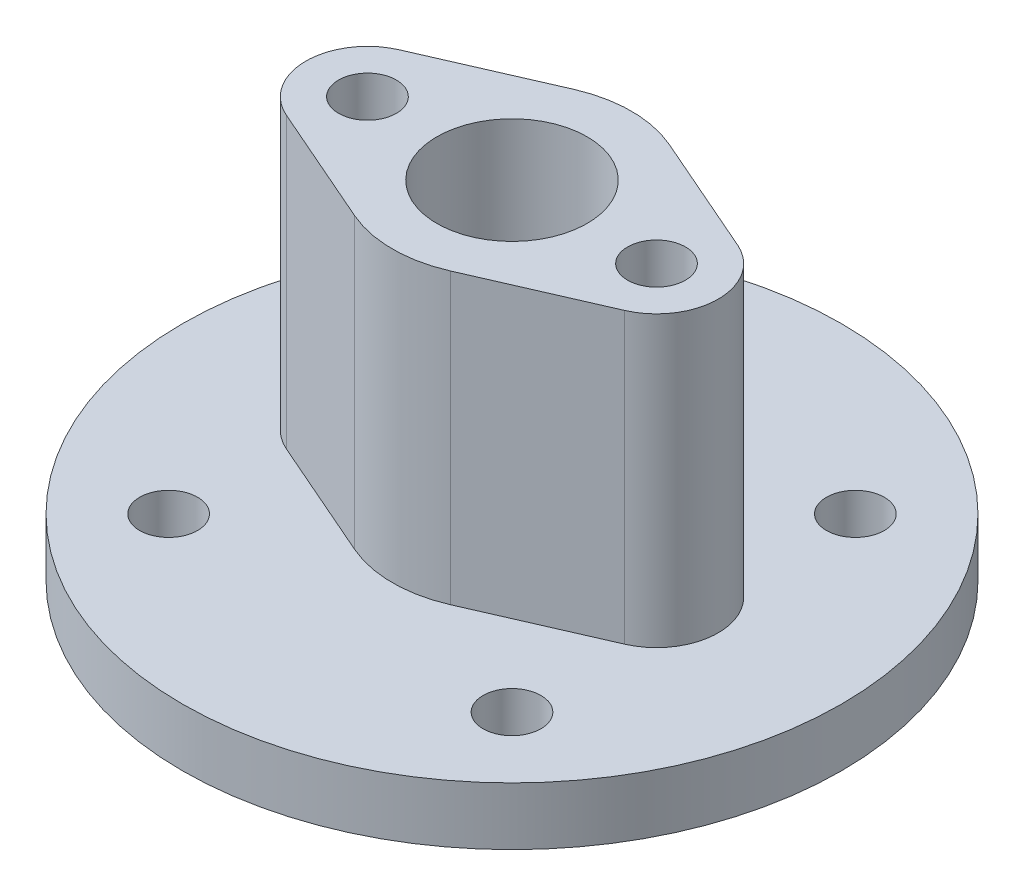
ISO-10303-21;
HEADER;
FILE_DESCRIPTION(('STEP AP214'),'2;1');
FILE_NAME('part.step','',(''),(''),'','','');
FILE_SCHEMA(('AUTOMOTIVE_DESIGN { 1 0 10303 214 1 1 1 1 }'));
ENDSEC;
DATA;
#1=APPLICATION_CONTEXT('core data for automotive mechanical design processes');
#2=APPLICATION_PROTOCOL_DEFINITION('international standard','automotive_design',2000,#1);
#3=PRODUCT_CONTEXT('',#1,'mechanical');
#4=PRODUCT('Part','Part','',(#3));
#5=PRODUCT_RELATED_PRODUCT_CATEGORY('part','',(#4));
#6=PRODUCT_DEFINITION_FORMATION('','',#4);
#7=PRODUCT_DEFINITION_CONTEXT('part definition',#1,'design');
#8=PRODUCT_DEFINITION('design','',#6,#7);
#9=PRODUCT_DEFINITION_SHAPE('','',#8);
#10=(LENGTH_UNIT() NAMED_UNIT(*) SI_UNIT(.MILLI.,.METRE.));
#11=(NAMED_UNIT(*) PLANE_ANGLE_UNIT() SI_UNIT($,.RADIAN.));
#12=(NAMED_UNIT(*) SI_UNIT($,.STERADIAN.) SOLID_ANGLE_UNIT());
#13=UNCERTAINTY_MEASURE_WITH_UNIT(LENGTH_MEASURE(1.E-05),#10,'distance_accuracy_value','');
#14=(GEOMETRIC_REPRESENTATION_CONTEXT(3) GLOBAL_UNCERTAINTY_ASSIGNED_CONTEXT((#13)) GLOBAL_UNIT_ASSIGNED_CONTEXT((#10,
#11,#12)) REPRESENTATION_CONTEXT('',''));
#15=CARTESIAN_POINT('',(0.,0.,0.));
#16=DIRECTION('',(0.,0.,1.));
#17=DIRECTION('',(1.,0.,0.));
#18=AXIS2_PLACEMENT_3D('',#15,#16,#17);
#19=CARTESIAN_POINT('',(0.,57.,0.));
#20=DIRECTION('',(0.,-1.,0.));
#21=DIRECTION('',(0.,0.,-1.));
#22=AXIS2_PLACEMENT_3D('',#19,#20,#21);
#23=PLANE('',#22);
#24=CARTESIAN_POINT('',(44.5477272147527,57.,-44.5477272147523));
#25=DIRECTION('',(0.,1.,0.));
#26=DIRECTION('',(0.,0.,1.));
#27=AXIS2_PLACEMENT_3D('',#24,#25,#26);
#28=CIRCLE('',#27,7.49999999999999);
#29=CARTESIAN_POINT('',(44.5477272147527,57.,-37.0477272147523));
#30=VERTEX_POINT('',#29);
#31=EDGE_CURVE('E126',#30,#30,#28,.T.);
#32=ORIENTED_EDGE('',*,*,#31,.F.);
#33=EDGE_LOOP('',(#32));
#34=FACE_BOUND('',#33,.T.);
#35=CARTESIAN_POINT('',(44.5477272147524,57.,44.5477272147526));
#36=DIRECTION('',(0.,1.,0.));
#37=DIRECTION('',(0.,0.,1.));
#38=AXIS2_PLACEMENT_3D('',#35,#36,#37);
#39=CIRCLE('',#38,7.49999999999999);
#40=CARTESIAN_POINT('',(44.5477272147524,57.,52.0477272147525));
#41=VERTEX_POINT('',#40);
#42=EDGE_CURVE('E132',#41,#41,#39,.T.);
#43=ORIENTED_EDGE('',*,*,#42,.F.);
#44=EDGE_LOOP('',(#43));
#45=FACE_BOUND('',#44,.T.);
#46=CARTESIAN_POINT('',(-44.5477272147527,57.,44.5477272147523));
#47=DIRECTION('',(0.,1.,0.));
#48=DIRECTION('',(0.,0.,1.));
#49=AXIS2_PLACEMENT_3D('',#46,#47,#48);
#50=CIRCLE('',#49,7.49999999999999);
#51=CARTESIAN_POINT('',(-44.5477272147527,57.,52.0477272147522));
#52=VERTEX_POINT('',#51);
#53=EDGE_CURVE('E138',#52,#52,#50,.T.);
#54=ORIENTED_EDGE('',*,*,#53,.F.);
#55=EDGE_LOOP('',(#54));
#56=FACE_BOUND('',#55,.T.);
#57=CARTESIAN_POINT('',(0.,57.,0.));
#58=DIRECTION('',(0.,1.,0.));
#59=DIRECTION('',(0.,0.,1.));
#60=AXIS2_PLACEMENT_3D('',#57,#58,#59);
#61=CIRCLE('',#60,85.5);
#62=CARTESIAN_POINT('',(0.,57.,85.5));
#63=VERTEX_POINT('',#62);
#64=EDGE_CURVE('E11',#63,#63,#61,.T.);
#65=ORIENTED_EDGE('',*,*,#64,.T.);
#66=EDGE_LOOP('',(#65));
#67=FACE_BOUND('',#66,.T.);
#68=CARTESIAN_POINT('',(0.,57.,0.));
#69=DIRECTION('',(0.,1.,0.));
#70=DIRECTION('',(0.,0.,1.));
#71=AXIS2_PLACEMENT_3D('',#68,#69,#70);
#72=CIRCLE('',#71,31.);
#73=CARTESIAN_POINT('',(12.4,57.,-28.4119693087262));
#74=VERTEX_POINT('',#73);
#75=CARTESIAN_POINT('',(-12.4,57.,-28.4119693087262));
#76=VERTEX_POINT('',#75);
#77=EDGE_CURVE('E168',#74,#76,#72,.T.);
#78=ORIENTED_EDGE('',*,*,#77,.F.);
#79=DIRECTION('',(-0.916515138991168,0.,-0.399999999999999));
#80=VECTOR('',#79,1.);
#81=CARTESIAN_POINT('',(12.4,57.,-28.4119693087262));
#82=LINE('',#81,#80);
#83=CARTESIAN_POINT('',(43.9,57.,-14.6642422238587));
#84=VERTEX_POINT('',#83);
#85=EDGE_CURVE('E173',#84,#74,#82,.T.);
#86=ORIENTED_EDGE('',*,*,#85,.F.);
#87=CARTESIAN_POINT('',(37.5,57.,0.));
#88=DIRECTION('',(0.,1.,0.));
#89=DIRECTION('',(0.,0.,1.));
#90=AXIS2_PLACEMENT_3D('',#87,#88,#89);
#91=CIRCLE('',#90,16.);
#92=CARTESIAN_POINT('',(43.9,57.,14.6642422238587));
#93=VERTEX_POINT('',#92);
#94=EDGE_CURVE('E201',#93,#84,#91,.T.);
#95=ORIENTED_EDGE('',*,*,#94,.F.);
#96=DIRECTION('',(0.916515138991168,0.,-0.4));
#97=VECTOR('',#96,1.);
#98=CARTESIAN_POINT('',(12.4,57.,28.4119693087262));
#99=LINE('',#98,#97);
#100=CARTESIAN_POINT('',(12.4,57.,28.4119693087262));
#101=VERTEX_POINT('',#100);
#102=EDGE_CURVE('E198',#101,#93,#99,.T.);
#103=ORIENTED_EDGE('',*,*,#102,.F.);
#104=CARTESIAN_POINT('',(0.,57.,0.));
#105=DIRECTION('',(0.,1.,0.));
#106=DIRECTION('',(0.,0.,1.));
#107=AXIS2_PLACEMENT_3D('',#104,#105,#106);
#108=CIRCLE('',#107,31.);
#109=CARTESIAN_POINT('',(-12.4,57.,28.4119693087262));
#110=VERTEX_POINT('',#109);
#111=EDGE_CURVE('E195',#110,#101,#108,.T.);
#112=ORIENTED_EDGE('',*,*,#111,.F.);
#113=DIRECTION('',(0.916515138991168,0.,0.4));
#114=VECTOR('',#113,1.);
#115=CARTESIAN_POINT('',(-43.9,57.,14.6642422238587));
#116=LINE('',#115,#114);
#117=CARTESIAN_POINT('',(-43.9,57.,14.6642422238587));
#118=VERTEX_POINT('',#117);
#119=EDGE_CURVE('E192',#118,#110,#116,.T.);
#120=ORIENTED_EDGE('',*,*,#119,.F.);
#121=CARTESIAN_POINT('',(-37.5,57.,0.));
#122=DIRECTION('',(0.,1.,0.));
#123=DIRECTION('',(0.,0.,1.));
#124=AXIS2_PLACEMENT_3D('',#121,#122,#123);
#125=CIRCLE('',#124,16.);
#126=CARTESIAN_POINT('',(-43.9,57.,-14.6642422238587));
#127=VERTEX_POINT('',#126);
#128=EDGE_CURVE('E52',#127,#118,#125,.T.);
#129=ORIENTED_EDGE('',*,*,#128,.F.);
#130=DIRECTION('',(-0.916515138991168,0.,0.399999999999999));
#131=VECTOR('',#130,1.);
#132=CARTESIAN_POINT('',(-43.9,57.,-14.6642422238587));
#133=LINE('',#132,#131);
#134=EDGE_CURVE('E47',#76,#127,#133,.T.);
#135=ORIENTED_EDGE('',*,*,#134,.F.);
#136=EDGE_LOOP('',(#78,#86,#95,#103,#112,#120,#129,#135));
#137=FACE_BOUND('',#136,.T.);
#138=CARTESIAN_POINT('',(-44.5477272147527,57.,-44.5477272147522));
#139=DIRECTION('',(0.,1.,0.));
#140=DIRECTION('',(0.,0.,1.));
#141=AXIS2_PLACEMENT_3D('',#138,#139,#140);
#142=CIRCLE('',#141,7.49999999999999);
#143=CARTESIAN_POINT('',(-44.5477272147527,57.,-37.0477272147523));
#144=VERTEX_POINT('',#143);
#145=EDGE_CURVE('E120',#144,#144,#142,.T.);
#146=ORIENTED_EDGE('',*,*,#145,.F.);
#147=EDGE_LOOP('',(#146));
#148=FACE_BOUND('',#147,.T.);
#149=ADVANCED_FACE('F32',(#34,#45,#56,#67,#137,#148),#23,.F.);
#150=CARTESIAN_POINT('',(24.,0.,0.));
#151=DIRECTION('',(0.,1.,0.));
#152=DIRECTION('',(0.,0.,1.));
#153=AXIS2_PLACEMENT_3D('',#150,#151,#152);
#154=PLANE('',#153);
#155=CARTESIAN_POINT('',(0.,0.,0.));
#156=DIRECTION('',(0.,-1.,0.));
#157=DIRECTION('',(0.,0.,-1.));
#158=AXIS2_PLACEMENT_3D('',#155,#156,#157);
#159=CIRCLE('',#158,13.5);
#160=CARTESIAN_POINT('',(0.,0.,-13.5));
#161=VERTEX_POINT('',#160);
#162=EDGE_CURVE('E144',#161,#161,#159,.T.);
#163=ORIENTED_EDGE('',*,*,#162,.F.);
#164=EDGE_LOOP('',(#163));
#165=FACE_BOUND('',#164,.T.);
#166=CARTESIAN_POINT('',(0.,0.,0.));
#167=DIRECTION('',(0.,1.,0.));
#168=DIRECTION('',(0.,0.,1.));
#169=AXIS2_PLACEMENT_3D('',#166,#167,#168);
#170=CIRCLE('',#169,24.);
#171=CARTESIAN_POINT('',(0.,0.,24.));
#172=VERTEX_POINT('',#171);
#173=EDGE_CURVE('E228',#172,#172,#170,.T.);
#174=ORIENTED_EDGE('',*,*,#173,.F.);
#175=EDGE_LOOP('',(#174));
#176=FACE_BOUND('',#175,.T.);
#177=ADVANCED_FACE('F34',(#165,#176),#154,.F.);
#178=CARTESIAN_POINT('',(0.,68.6951943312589,0.));
#179=DIRECTION('',(0.,1.,0.));
#180=DIRECTION('',(0.,0.,1.));
#181=AXIS2_PLACEMENT_3D('',#178,#179,#180);
#182=CYLINDRICAL_SURFACE('',#181,85.5);
#183=ORIENTED_EDGE('',*,*,#64,.F.);
#184=EDGE_LOOP('',(#183));
#185=FACE_BOUND('',#184,.T.);
#186=CARTESIAN_POINT('',(0.,42.,0.));
#187=DIRECTION('',(0.,1.,0.));
#188=DIRECTION('',(0.,0.,1.));
#189=AXIS2_PLACEMENT_3D('',#186,#187,#188);
#190=CIRCLE('',#189,85.5);
#191=CARTESIAN_POINT('',(0.,42.,85.5));
#192=VERTEX_POINT('',#191);
#193=EDGE_CURVE('E40',#192,#192,#190,.T.);
#194=ORIENTED_EDGE('',*,*,#193,.T.);
#195=EDGE_LOOP('',(#194));
#196=FACE_BOUND('',#195,.T.);
#197=ADVANCED_FACE('F236',(#185,#196),#182,.T.);
#198=CARTESIAN_POINT('',(85.5,42.,0.));
#199=DIRECTION('',(0.,1.,0.));
#200=DIRECTION('',(0.,0.,1.));
#201=AXIS2_PLACEMENT_3D('',#198,#199,#200);
#202=PLANE('',#201);
#203=CARTESIAN_POINT('',(-44.5477272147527,42.,-44.5477272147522));
#204=DIRECTION('',(0.,1.,0.));
#205=DIRECTION('',(0.,0.,1.));
#206=AXIS2_PLACEMENT_3D('',#203,#204,#205);
#207=CIRCLE('',#206,7.49999999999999);
#208=CARTESIAN_POINT('',(-44.5477272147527,42.,-37.0477272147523));
#209=VERTEX_POINT('',#208);
#210=EDGE_CURVE('E123',#209,#209,#207,.T.);
#211=ORIENTED_EDGE('',*,*,#210,.T.);
#212=EDGE_LOOP('',(#211));
#213=FACE_BOUND('',#212,.T.);
#214=CARTESIAN_POINT('',(44.5477272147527,42.,-44.5477272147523));
#215=DIRECTION('',(0.,1.,0.));
#216=DIRECTION('',(0.,0.,1.));
#217=AXIS2_PLACEMENT_3D('',#214,#215,#216);
#218=CIRCLE('',#217,7.49999999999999);
#219=CARTESIAN_POINT('',(44.5477272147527,42.,-37.0477272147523));
#220=VERTEX_POINT('',#219);
#221=EDGE_CURVE('E129',#220,#220,#218,.T.);
#222=ORIENTED_EDGE('',*,*,#221,.T.);
#223=EDGE_LOOP('',(#222));
#224=FACE_BOUND('',#223,.T.);
#225=CARTESIAN_POINT('',(44.5477272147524,42.,44.5477272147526));
#226=DIRECTION('',(0.,1.,0.));
#227=DIRECTION('',(0.,0.,1.));
#228=AXIS2_PLACEMENT_3D('',#225,#226,#227);
#229=CIRCLE('',#228,7.49999999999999);
#230=CARTESIAN_POINT('',(44.5477272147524,42.,52.0477272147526));
#231=VERTEX_POINT('',#230);
#232=EDGE_CURVE('E135',#231,#231,#229,.T.);
#233=ORIENTED_EDGE('',*,*,#232,.T.);
#234=EDGE_LOOP('',(#233));
#235=FACE_BOUND('',#234,.T.);
#236=CARTESIAN_POINT('',(-44.5477272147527,42.,44.5477272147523));
#237=DIRECTION('',(0.,1.,0.));
#238=DIRECTION('',(0.,0.,1.));
#239=AXIS2_PLACEMENT_3D('',#236,#237,#238);
#240=CIRCLE('',#239,7.49999999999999);
#241=CARTESIAN_POINT('',(-44.5477272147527,42.,52.0477272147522));
#242=VERTEX_POINT('',#241);
#243=EDGE_CURVE('E141',#242,#242,#240,.T.);
#244=ORIENTED_EDGE('',*,*,#243,.T.);
#245=EDGE_LOOP('',(#244));
#246=FACE_BOUND('',#245,.T.);
#247=ORIENTED_EDGE('',*,*,#193,.F.);
#248=EDGE_LOOP('',(#247));
#249=FACE_BOUND('',#248,.T.);
#250=CARTESIAN_POINT('',(0.,42.,0.));
#251=DIRECTION('',(0.,1.,0.));
#252=DIRECTION('',(0.,0.,1.));
#253=AXIS2_PLACEMENT_3D('',#250,#251,#252);
#254=CIRCLE('',#253,42.);
#255=CARTESIAN_POINT('',(0.,42.,42.));
#256=VERTEX_POINT('',#255);
#257=EDGE_CURVE('E231',#256,#256,#254,.T.);
#258=ORIENTED_EDGE('',*,*,#257,.T.);
#259=EDGE_LOOP('',(#258));
#260=FACE_BOUND('',#259,.T.);
#261=ADVANCED_FACE('F238',(#213,#224,#235,#246,#249,#260),#202,.F.);
#262=CARTESIAN_POINT('',(0.,0.,0.));
#263=DIRECTION('',(0.,1.,0.));
#264=DIRECTION('',(0.,0.,1.));
#265=AXIS2_PLACEMENT_3D('',#262,#263,#264);
#266=CONICAL_SURFACE('',#265,24.,0.404891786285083);
#267=ORIENTED_EDGE('',*,*,#257,.F.);
#268=EDGE_LOOP('',(#267));
#269=FACE_BOUND('',#268,.T.);
#270=ORIENTED_EDGE('',*,*,#173,.T.);
#271=EDGE_LOOP('',(#270));
#272=FACE_BOUND('',#271,.T.);
#273=ADVANCED_FACE('F241',(#269,#272),#266,.T.);
#274=CARTESIAN_POINT('',(0.,132.,0.));
#275=DIRECTION('',(0.,-1.,0.));
#276=DIRECTION('',(0.,0.,-1.));
#277=AXIS2_PLACEMENT_3D('',#274,#275,#276);
#278=CYLINDRICAL_SURFACE('',#277,31.);
#279=ORIENTED_EDGE('',*,*,#77,.T.);
#280=DIRECTION('',(0.,-1.,0.));
#281=VECTOR('',#280,1.);
#282=CARTESIAN_POINT('',(-12.4,132.,-28.4119693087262));
#283=LINE('',#282,#281);
#284=CARTESIAN_POINT('',(-12.4,132.,-28.4119693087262));
#285=VERTEX_POINT('',#284);
#286=EDGE_CURVE('E226',#285,#76,#283,.T.);
#287=ORIENTED_EDGE('',*,*,#286,.F.);
#288=CARTESIAN_POINT('',(0.,132.,0.));
#289=DIRECTION('',(0.,1.,0.));
#290=DIRECTION('',(0.,0.,1.));
#291=AXIS2_PLACEMENT_3D('',#288,#289,#290);
#292=CIRCLE('',#291,31.);
#293=CARTESIAN_POINT('',(12.4,132.,-28.4119693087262));
#294=VERTEX_POINT('',#293);
#295=EDGE_CURVE('E169',#294,#285,#292,.T.);
#296=ORIENTED_EDGE('',*,*,#295,.F.);
#297=DIRECTION('',(0.,-1.,0.));
#298=VECTOR('',#297,1.);
#299=CARTESIAN_POINT('',(12.4,132.,-28.4119693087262));
#300=LINE('',#299,#298);
#301=EDGE_CURVE('E187',#294,#74,#300,.T.);
#302=ORIENTED_EDGE('',*,*,#301,.T.);
#303=EDGE_LOOP('',(#279,#287,#296,#302));
#304=FACE_BOUND('',#303,.T.);
#305=ADVANCED_FACE('F248',(#304),#278,.T.);
#306=CARTESIAN_POINT('',(-43.9,132.,-14.6642422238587));
#307=DIRECTION('',(0.399999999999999,0.,0.916515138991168));
#308=DIRECTION('',(0.916515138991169,0.,-0.399999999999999));
#309=AXIS2_PLACEMENT_3D('',#306,#307,#308);
#310=PLANE('',#309);
#311=ORIENTED_EDGE('',*,*,#134,.T.);
#312=DIRECTION('',(0.,-1.,0.));
#313=VECTOR('',#312,1.);
#314=CARTESIAN_POINT('',(-43.9,132.,-14.6642422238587));
#315=LINE('',#314,#313);
#316=CARTESIAN_POINT('',(-43.9,132.,-14.6642422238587));
#317=VERTEX_POINT('',#316);
#318=EDGE_CURVE('E223',#317,#127,#315,.T.);
#319=ORIENTED_EDGE('',*,*,#318,.F.);
#320=DIRECTION('',(-0.916515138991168,0.,0.399999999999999));
#321=VECTOR('',#320,1.);
#322=CARTESIAN_POINT('',(-43.9,132.,-14.6642422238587));
#323=LINE('',#322,#321);
#324=EDGE_CURVE('E172',#285,#317,#323,.T.);
#325=ORIENTED_EDGE('',*,*,#324,.F.);
#326=ORIENTED_EDGE('',*,*,#286,.T.);
#327=EDGE_LOOP('',(#311,#319,#325,#326));
#328=FACE_BOUND('',#327,.T.);
#329=ADVANCED_FACE('F328',(#328),#310,.F.);
#330=CARTESIAN_POINT('',(-37.5,132.,0.));
#331=DIRECTION('',(0.,-1.,0.));
#332=DIRECTION('',(0.,0.,-1.));
#333=AXIS2_PLACEMENT_3D('',#330,#331,#332);
#334=CYLINDRICAL_SURFACE('',#333,16.);
#335=ORIENTED_EDGE('',*,*,#128,.T.);
#336=DIRECTION('',(0.,-1.,0.));
#337=VECTOR('',#336,1.);
#338=CARTESIAN_POINT('',(-43.9,132.,14.6642422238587));
#339=LINE('',#338,#337);
#340=CARTESIAN_POINT('',(-43.9,132.,14.6642422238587));
#341=VERTEX_POINT('',#340);
#342=EDGE_CURVE('E220',#341,#118,#339,.T.);
#343=ORIENTED_EDGE('',*,*,#342,.F.);
#344=CARTESIAN_POINT('',(-37.5,132.,0.));
#345=DIRECTION('',(0.,1.,0.));
#346=DIRECTION('',(0.,0.,1.));
#347=AXIS2_PLACEMENT_3D('',#344,#345,#346);
#348=CIRCLE('',#347,16.);
#349=EDGE_CURVE('E175',#317,#341,#348,.T.);
#350=ORIENTED_EDGE('',*,*,#349,.F.);
#351=ORIENTED_EDGE('',*,*,#318,.T.);
#352=EDGE_LOOP('',(#335,#343,#350,#351));
#353=FACE_BOUND('',#352,.T.);
#354=ADVANCED_FACE('F324',(#353),#334,.T.);
#355=CARTESIAN_POINT('',(-43.9,132.,14.6642422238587));
#356=DIRECTION('',(0.4,0.,-0.916515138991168));
#357=DIRECTION('',(-0.916515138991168,0.,-0.4));
#358=AXIS2_PLACEMENT_3D('',#355,#356,#357);
#359=PLANE('',#358);
#360=ORIENTED_EDGE('',*,*,#119,.T.);
#361=DIRECTION('',(0.,-1.,0.));
#362=VECTOR('',#361,1.);
#363=CARTESIAN_POINT('',(-12.4,132.,28.4119693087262));
#364=LINE('',#363,#362);
#365=CARTESIAN_POINT('',(-12.4,132.,28.4119693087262));
#366=VERTEX_POINT('',#365);
#367=EDGE_CURVE('E217',#366,#110,#364,.T.);
#368=ORIENTED_EDGE('',*,*,#367,.F.);
#369=DIRECTION('',(0.916515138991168,0.,0.4));
#370=VECTOR('',#369,1.);
#371=CARTESIAN_POINT('',(-43.9,132.,14.6642422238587));
#372=LINE('',#371,#370);
#373=EDGE_CURVE('E177',#341,#366,#372,.T.);
#374=ORIENTED_EDGE('',*,*,#373,.F.);
#375=ORIENTED_EDGE('',*,*,#342,.T.);
#376=EDGE_LOOP('',(#360,#368,#374,#375));
#377=FACE_BOUND('',#376,.T.);
#378=ADVANCED_FACE('F320',(#377),#359,.F.);
#379=CARTESIAN_POINT('',(0.,132.,0.));
#380=DIRECTION('',(0.,-1.,0.));
#381=DIRECTION('',(0.,0.,-1.));
#382=AXIS2_PLACEMENT_3D('',#379,#380,#381);
#383=CYLINDRICAL_SURFACE('',#382,31.);
#384=ORIENTED_EDGE('',*,*,#111,.T.);
#385=DIRECTION('',(0.,-1.,0.));
#386=VECTOR('',#385,1.);
#387=CARTESIAN_POINT('',(12.4,132.,28.4119693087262));
#388=LINE('',#387,#386);
#389=CARTESIAN_POINT('',(12.4,132.,28.4119693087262));
#390=VERTEX_POINT('',#389);
#391=EDGE_CURVE('E214',#390,#101,#388,.T.);
#392=ORIENTED_EDGE('',*,*,#391,.F.);
#393=CARTESIAN_POINT('',(0.,132.,0.));
#394=DIRECTION('',(0.,1.,0.));
#395=DIRECTION('',(0.,0.,1.));
#396=AXIS2_PLACEMENT_3D('',#393,#394,#395);
#397=CIRCLE('',#396,31.);
#398=EDGE_CURVE('E179',#366,#390,#397,.T.);
#399=ORIENTED_EDGE('',*,*,#398,.F.);
#400=ORIENTED_EDGE('',*,*,#367,.T.);
#401=EDGE_LOOP('',(#384,#392,#399,#400));
#402=FACE_BOUND('',#401,.T.);
#403=ADVANCED_FACE('F316',(#402),#383,.T.);
#404=CARTESIAN_POINT('',(12.4,132.,28.4119693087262));
#405=DIRECTION('',(-0.4,0.,-0.916515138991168));
#406=DIRECTION('',(-0.916515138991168,0.,0.4));
#407=AXIS2_PLACEMENT_3D('',#404,#405,#406);
#408=PLANE('',#407);
#409=ORIENTED_EDGE('',*,*,#102,.T.);
#410=DIRECTION('',(0.,-1.,0.));
#411=VECTOR('',#410,1.);
#412=CARTESIAN_POINT('',(43.9,132.,14.6642422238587));
#413=LINE('',#412,#411);
#414=CARTESIAN_POINT('',(43.9,132.,14.6642422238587));
#415=VERTEX_POINT('',#414);
#416=EDGE_CURVE('E211',#415,#93,#413,.T.);
#417=ORIENTED_EDGE('',*,*,#416,.F.);
#418=DIRECTION('',(0.916515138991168,0.,-0.4));
#419=VECTOR('',#418,1.);
#420=CARTESIAN_POINT('',(12.4,132.,28.4119693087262));
#421=LINE('',#420,#419);
#422=EDGE_CURVE('E181',#390,#415,#421,.T.);
#423=ORIENTED_EDGE('',*,*,#422,.F.);
#424=ORIENTED_EDGE('',*,*,#391,.T.);
#425=EDGE_LOOP('',(#409,#417,#423,#424));
#426=FACE_BOUND('',#425,.T.);
#427=ADVANCED_FACE('F312',(#426),#408,.F.);
#428=CARTESIAN_POINT('',(37.5,132.,0.));
#429=DIRECTION('',(0.,-1.,0.));
#430=DIRECTION('',(0.,0.,-1.));
#431=AXIS2_PLACEMENT_3D('',#428,#429,#430);
#432=CYLINDRICAL_SURFACE('',#431,16.);
#433=ORIENTED_EDGE('',*,*,#94,.T.);
#434=DIRECTION('',(0.,-1.,0.));
#435=VECTOR('',#434,1.);
#436=CARTESIAN_POINT('',(43.9,132.,-14.6642422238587));
#437=LINE('',#436,#435);
#438=CARTESIAN_POINT('',(43.9,132.,-14.6642422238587));
#439=VERTEX_POINT('',#438);
#440=EDGE_CURVE('E208',#439,#84,#437,.T.);
#441=ORIENTED_EDGE('',*,*,#440,.F.);
#442=CARTESIAN_POINT('',(37.5,132.,0.));
#443=DIRECTION('',(0.,1.,0.));
#444=DIRECTION('',(0.,0.,1.));
#445=AXIS2_PLACEMENT_3D('',#442,#443,#444);
#446=CIRCLE('',#445,16.);
#447=EDGE_CURVE('E183',#415,#439,#446,.T.);
#448=ORIENTED_EDGE('',*,*,#447,.F.);
#449=ORIENTED_EDGE('',*,*,#416,.T.);
#450=EDGE_LOOP('',(#433,#441,#448,#449));
#451=FACE_BOUND('',#450,.T.);
#452=ADVANCED_FACE('F308',(#451),#432,.T.);
#453=CARTESIAN_POINT('',(12.4,132.,-28.4119693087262));
#454=DIRECTION('',(-0.399999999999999,0.,0.916515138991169));
#455=DIRECTION('',(0.916515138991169,0.,0.399999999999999));
#456=AXIS2_PLACEMENT_3D('',#453,#454,#455);
#457=PLANE('',#456);
#458=ORIENTED_EDGE('',*,*,#85,.T.);
#459=ORIENTED_EDGE('',*,*,#301,.F.);
#460=DIRECTION('',(-0.916515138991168,0.,-0.399999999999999));
#461=VECTOR('',#460,1.);
#462=CARTESIAN_POINT('',(12.4,132.,-28.4119693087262));
#463=LINE('',#462,#461);
#464=EDGE_CURVE('E185',#439,#294,#463,.T.);
#465=ORIENTED_EDGE('',*,*,#464,.F.);
#466=ORIENTED_EDGE('',*,*,#440,.T.);
#467=EDGE_LOOP('',(#458,#459,#465,#466));
#468=FACE_BOUND('',#467,.T.);
#469=ADVANCED_FACE('F304',(#468),#457,.F.);
#470=CARTESIAN_POINT('',(0.,132.,0.));
#471=DIRECTION('',(0.,1.,0.));
#472=DIRECTION('',(0.,0.,1.));
#473=AXIS2_PLACEMENT_3D('',#470,#471,#472);
#474=PLANE('',#473);
#475=CARTESIAN_POINT('',(-37.5,132.,0.));
#476=DIRECTION('',(0.,1.,0.));
#477=DIRECTION('',(0.,0.,1.));
#478=AXIS2_PLACEMENT_3D('',#475,#476,#477);
#479=CIRCLE('',#478,7.49999999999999);
#480=CARTESIAN_POINT('',(-37.5,132.,7.49999999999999));
#481=VERTEX_POINT('',#480);
#482=EDGE_CURVE('E110',#481,#481,#479,.T.);
#483=ORIENTED_EDGE('',*,*,#482,.F.);
#484=EDGE_LOOP('',(#483));
#485=FACE_BOUND('',#484,.T.);
#486=CARTESIAN_POINT('',(37.5,132.,0.));
#487=DIRECTION('',(0.,1.,0.));
#488=DIRECTION('',(0.,0.,1.));
#489=AXIS2_PLACEMENT_3D('',#486,#487,#488);
#490=CIRCLE('',#489,7.49999999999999);
#491=CARTESIAN_POINT('',(37.5,132.,7.49999999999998));
#492=VERTEX_POINT('',#491);
#493=EDGE_CURVE('E109',#492,#492,#490,.T.);
#494=ORIENTED_EDGE('',*,*,#493,.F.);
#495=EDGE_LOOP('',(#494));
#496=FACE_BOUND('',#495,.T.);
#497=CARTESIAN_POINT('',(0.,132.,0.));
#498=DIRECTION('',(0.,-1.,0.));
#499=DIRECTION('',(0.,0.,-1.));
#500=AXIS2_PLACEMENT_3D('',#497,#498,#499);
#501=CIRCLE('',#500,19.5);
#502=CARTESIAN_POINT('',(0.,132.,-19.5));
#503=VERTEX_POINT('',#502);
#504=EDGE_CURVE('E165',#503,#503,#501,.T.);
#505=ORIENTED_EDGE('',*,*,#504,.T.);
#506=EDGE_LOOP('',(#505));
#507=FACE_BOUND('',#506,.T.);
#508=ORIENTED_EDGE('',*,*,#295,.T.);
#509=ORIENTED_EDGE('',*,*,#324,.T.);
#510=ORIENTED_EDGE('',*,*,#349,.T.);
#511=ORIENTED_EDGE('',*,*,#373,.T.);
#512=ORIENTED_EDGE('',*,*,#398,.T.);
#513=ORIENTED_EDGE('',*,*,#422,.T.);
#514=ORIENTED_EDGE('',*,*,#447,.T.);
#515=ORIENTED_EDGE('',*,*,#464,.T.);
#516=EDGE_LOOP('',(#508,#509,#510,#511,#512,#513,#514,#515));
#517=FACE_BOUND('',#516,.T.);
#518=ADVANCED_FACE('F300',(#485,#496,#507,#517),#474,.T.);
#519=CARTESIAN_POINT('',(0.,-11.1962027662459,0.));
#520=DIRECTION('',(0.,-1.,0.));
#521=DIRECTION('',(0.,0.,-1.));
#522=AXIS2_PLACEMENT_3D('',#519,#520,#521);
#523=CYLINDRICAL_SURFACE('',#522,19.5);
#524=ORIENTED_EDGE('',*,*,#504,.F.);
#525=EDGE_LOOP('',(#524));
#526=FACE_BOUND('',#525,.T.);
#527=CARTESIAN_POINT('',(0.,102.,0.));
#528=DIRECTION('',(0.,-1.,0.));
#529=DIRECTION('',(0.,0.,-1.));
#530=AXIS2_PLACEMENT_3D('',#527,#528,#529);
#531=CIRCLE('',#530,19.5);
#532=CARTESIAN_POINT('',(0.,102.,-19.5));
#533=VERTEX_POINT('',#532);
#534=EDGE_CURVE('E162',#533,#533,#531,.T.);
#535=ORIENTED_EDGE('',*,*,#534,.T.);
#536=EDGE_LOOP('',(#535));
#537=FACE_BOUND('',#536,.T.);
#538=ADVANCED_FACE('F296',(#526,#537),#523,.F.);
#539=CARTESIAN_POINT('',(19.5,102.,0.));
#540=DIRECTION('',(0.,-1.,0.));
#541=DIRECTION('',(0.,0.,-1.));
#542=AXIS2_PLACEMENT_3D('',#539,#540,#541);
#543=PLANE('',#542);
#544=ORIENTED_EDGE('',*,*,#534,.F.);
#545=EDGE_LOOP('',(#544));
#546=FACE_BOUND('',#545,.T.);
#547=CARTESIAN_POINT('',(0.,102.,0.));
#548=DIRECTION('',(0.,-1.,0.));
#549=DIRECTION('',(0.,0.,-1.));
#550=AXIS2_PLACEMENT_3D('',#547,#548,#549);
#551=CIRCLE('',#550,10.5);
#552=CARTESIAN_POINT('',(0.,102.,-10.5));
#553=VERTEX_POINT('',#552);
#554=EDGE_CURVE('E159',#553,#553,#551,.T.);
#555=ORIENTED_EDGE('',*,*,#554,.T.);
#556=EDGE_LOOP('',(#555));
#557=FACE_BOUND('',#556,.T.);
#558=ADVANCED_FACE('F292',(#546,#557),#543,.F.);
#559=CARTESIAN_POINT('',(0.,-11.1962027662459,0.));
#560=DIRECTION('',(0.,-1.,0.));
#561=DIRECTION('',(0.,0.,-1.));
#562=AXIS2_PLACEMENT_3D('',#559,#560,#561);
#563=CYLINDRICAL_SURFACE('',#562,10.5);
#564=ORIENTED_EDGE('',*,*,#554,.F.);
#565=EDGE_LOOP('',(#564));
#566=FACE_BOUND('',#565,.T.);
#567=CARTESIAN_POINT('',(0.,90.,0.));
#568=DIRECTION('',(0.,-1.,0.));
#569=DIRECTION('',(0.,0.,-1.));
#570=AXIS2_PLACEMENT_3D('',#567,#568,#569);
#571=CIRCLE('',#570,10.5);
#572=CARTESIAN_POINT('',(0.,90.,-10.5));
#573=VERTEX_POINT('',#572);
#574=EDGE_CURVE('E156',#573,#573,#571,.T.);
#575=ORIENTED_EDGE('',*,*,#574,.T.);
#576=EDGE_LOOP('',(#575));
#577=FACE_BOUND('',#576,.T.);
#578=ADVANCED_FACE('F288',(#566,#577),#563,.F.);
#579=CARTESIAN_POINT('',(10.5,90.,0.));
#580=DIRECTION('',(0.,1.,0.));
#581=DIRECTION('',(0.,0.,1.));
#582=AXIS2_PLACEMENT_3D('',#579,#580,#581);
#583=PLANE('',#582);
#584=ORIENTED_EDGE('',*,*,#574,.F.);
#585=EDGE_LOOP('',(#584));
#586=FACE_BOUND('',#585,.T.);
#587=CARTESIAN_POINT('',(0.,90.,0.));
#588=DIRECTION('',(0.,-1.,0.));
#589=DIRECTION('',(0.,0.,-1.));
#590=AXIS2_PLACEMENT_3D('',#587,#588,#589);
#591=CIRCLE('',#590,19.5);
#592=CARTESIAN_POINT('',(0.,90.,-19.5));
#593=VERTEX_POINT('',#592);
#594=EDGE_CURVE('E153',#593,#593,#591,.T.);
#595=ORIENTED_EDGE('',*,*,#594,.T.);
#596=EDGE_LOOP('',(#595));
#597=FACE_BOUND('',#596,.T.);
#598=ADVANCED_FACE('F284',(#586,#597),#583,.F.);
#599=CARTESIAN_POINT('',(0.,-11.1962027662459,0.));
#600=DIRECTION('',(0.,-1.,0.));
#601=DIRECTION('',(0.,0.,-1.));
#602=AXIS2_PLACEMENT_3D('',#599,#600,#601);
#603=CYLINDRICAL_SURFACE('',#602,19.5);
#604=ORIENTED_EDGE('',*,*,#594,.F.);
#605=EDGE_LOOP('',(#604));
#606=FACE_BOUND('',#605,.T.);
#607=CARTESIAN_POINT('',(0.,66.,0.));
#608=DIRECTION('',(0.,-1.,0.));
#609=DIRECTION('',(0.,0.,-1.));
#610=AXIS2_PLACEMENT_3D('',#607,#608,#609);
#611=CIRCLE('',#610,19.5);
#612=CARTESIAN_POINT('',(0.,66.,-19.5));
#613=VERTEX_POINT('',#612);
#614=EDGE_CURVE('E150',#613,#613,#611,.T.);
#615=ORIENTED_EDGE('',*,*,#614,.T.);
#616=EDGE_LOOP('',(#615));
#617=FACE_BOUND('',#616,.T.);
#618=ADVANCED_FACE('F276',(#606,#617),#603,.F.);
#619=CARTESIAN_POINT('',(19.5,66.,0.));
#620=DIRECTION('',(0.,-1.,0.));
#621=DIRECTION('',(0.,0.,-1.));
#622=AXIS2_PLACEMENT_3D('',#619,#620,#621);
#623=PLANE('',#622);
#624=ORIENTED_EDGE('',*,*,#614,.F.);
#625=EDGE_LOOP('',(#624));
#626=FACE_BOUND('',#625,.T.);
#627=CARTESIAN_POINT('',(0.,66.,0.));
#628=DIRECTION('',(0.,-1.,0.));
#629=DIRECTION('',(0.,0.,-1.));
#630=AXIS2_PLACEMENT_3D('',#627,#628,#629);
#631=CIRCLE('',#630,13.5);
#632=CARTESIAN_POINT('',(0.,66.,-13.5));
#633=VERTEX_POINT('',#632);
#634=EDGE_CURVE('E147',#633,#633,#631,.T.);
#635=ORIENTED_EDGE('',*,*,#634,.T.);
#636=EDGE_LOOP('',(#635));
#637=FACE_BOUND('',#636,.T.);
#638=ADVANCED_FACE('F266',(#626,#637),#623,.F.);
#639=CARTESIAN_POINT('',(0.,-11.1962027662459,0.));
#640=DIRECTION('',(0.,-1.,0.));
#641=DIRECTION('',(0.,0.,-1.));
#642=AXIS2_PLACEMENT_3D('',#639,#640,#641);
#643=CYLINDRICAL_SURFACE('',#642,13.5);
#644=ORIENTED_EDGE('',*,*,#634,.F.);
#645=EDGE_LOOP('',(#644));
#646=FACE_BOUND('',#645,.T.);
#647=ORIENTED_EDGE('',*,*,#162,.T.);
#648=EDGE_LOOP('',(#647));
#649=FACE_BOUND('',#648,.T.);
#650=ADVANCED_FACE('F263',(#646,#649),#643,.F.);
#651=CARTESIAN_POINT('',(-44.5477272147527,57.,44.5477272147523));
#652=DIRECTION('',(0.,1.,0.));
#653=DIRECTION('',(0.,0.,1.));
#654=AXIS2_PLACEMENT_3D('',#651,#652,#653);
#655=CYLINDRICAL_SURFACE('',#654,7.49999999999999);
#656=ORIENTED_EDGE('',*,*,#243,.F.);
#657=EDGE_LOOP('',(#656));
#658=FACE_BOUND('',#657,.T.);
#659=ORIENTED_EDGE('',*,*,#53,.T.);
#660=EDGE_LOOP('',(#659));
#661=FACE_BOUND('',#660,.T.);
#662=ADVANCED_FACE('F265',(#658,#661),#655,.F.);
#663=CARTESIAN_POINT('',(44.5477272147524,57.,44.5477272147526));
#664=DIRECTION('',(0.,1.,0.));
#665=DIRECTION('',(0.,0.,1.));
#666=AXIS2_PLACEMENT_3D('',#663,#664,#665);
#667=CYLINDRICAL_SURFACE('',#666,7.49999999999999);
#668=ORIENTED_EDGE('',*,*,#232,.F.);
#669=EDGE_LOOP('',(#668));
#670=FACE_BOUND('',#669,.T.);
#671=ORIENTED_EDGE('',*,*,#42,.T.);
#672=EDGE_LOOP('',(#671));
#673=FACE_BOUND('',#672,.T.);
#674=ADVANCED_FACE('F273',(#670,#673),#667,.F.);
#675=CARTESIAN_POINT('',(44.5477272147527,57.,-44.5477272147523));
#676=DIRECTION('',(0.,1.,0.));
#677=DIRECTION('',(0.,0.,1.));
#678=AXIS2_PLACEMENT_3D('',#675,#676,#677);
#679=CYLINDRICAL_SURFACE('',#678,7.49999999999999);
#680=ORIENTED_EDGE('',*,*,#221,.F.);
#681=EDGE_LOOP('',(#680));
#682=FACE_BOUND('',#681,.T.);
#683=ORIENTED_EDGE('',*,*,#31,.T.);
#684=EDGE_LOOP('',(#683));
#685=FACE_BOUND('',#684,.T.);
#686=ADVANCED_FACE('F359',(#682,#685),#679,.F.);
#687=CARTESIAN_POINT('',(-44.5477272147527,57.,-44.5477272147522));
#688=DIRECTION('',(0.,1.,0.));
#689=DIRECTION('',(0.,0.,1.));
#690=AXIS2_PLACEMENT_3D('',#687,#688,#689);
#691=CYLINDRICAL_SURFACE('',#690,7.49999999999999);
#692=ORIENTED_EDGE('',*,*,#210,.F.);
#693=EDGE_LOOP('',(#692));
#694=FACE_BOUND('',#693,.T.);
#695=ORIENTED_EDGE('',*,*,#145,.T.);
#696=EDGE_LOOP('',(#695));
#697=FACE_BOUND('',#696,.T.);
#698=ADVANCED_FACE('F356',(#694,#697),#691,.F.);
#699=CARTESIAN_POINT('',(37.5,107.,0.));
#700=DIRECTION('',(0.,1.,0.));
#701=DIRECTION('',(0.,0.,1.));
#702=AXIS2_PLACEMENT_3D('',#699,#700,#701);
#703=CONICAL_SURFACE('',#702,7.49999999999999,1.02974425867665);
#704=CARTESIAN_POINT('',(37.5,102.493545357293,0.));
#705=VERTEX_POINT('',#704);
#706=VERTEX_LOOP('',#705);
#707=FACE_BOUND('',#706,.T.);
#708=CARTESIAN_POINT('',(37.5,107.,0.));
#709=DIRECTION('',(0.,1.,0.));
#710=DIRECTION('',(0.,0.,1.));
#711=AXIS2_PLACEMENT_3D('',#708,#709,#710);
#712=CIRCLE('',#711,7.49999999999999);
#713=CARTESIAN_POINT('',(37.5,107.,7.49999999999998));
#714=VERTEX_POINT('',#713);
#715=EDGE_CURVE('E113',#714,#714,#712,.T.);
#716=ORIENTED_EDGE('',*,*,#715,.T.);
#717=EDGE_LOOP('',(#716));
#718=FACE_BOUND('',#717,.T.);
#719=ADVANCED_FACE('F358',(#707,#718),#703,.F.);
#720=CARTESIAN_POINT('',(37.5,132.,0.));
#721=DIRECTION('',(0.,1.,0.));
#722=DIRECTION('',(0.,0.,1.));
#723=AXIS2_PLACEMENT_3D('',#720,#721,#722);
#724=CYLINDRICAL_SURFACE('',#723,7.49999999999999);
#725=ORIENTED_EDGE('',*,*,#715,.F.);
#726=EDGE_LOOP('',(#725));
#727=FACE_BOUND('',#726,.T.);
#728=ORIENTED_EDGE('',*,*,#493,.T.);
#729=EDGE_LOOP('',(#728));
#730=FACE_BOUND('',#729,.T.);
#731=ADVANCED_FACE('F103',(#727,#730),#724,.F.);
#732=CARTESIAN_POINT('',(-37.5,107.,0.));
#733=DIRECTION('',(0.,1.,0.));
#734=DIRECTION('',(0.,0.,1.));
#735=AXIS2_PLACEMENT_3D('',#732,#733,#734);
#736=CONICAL_SURFACE('',#735,7.5,1.02974425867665);
#737=CARTESIAN_POINT('',(-37.5,102.493545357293,0.));
#738=VERTEX_POINT('',#737);
#739=VERTEX_LOOP('',#738);
#740=FACE_BOUND('',#739,.T.);
#741=CARTESIAN_POINT('',(-37.5,107.,0.));
#742=DIRECTION('',(0.,1.,0.));
#743=DIRECTION('',(0.,0.,1.));
#744=AXIS2_PLACEMENT_3D('',#741,#742,#743);
#745=CIRCLE('',#744,7.5);
#746=CARTESIAN_POINT('',(-37.5,107.,7.5));
#747=VERTEX_POINT('',#746);
#748=EDGE_CURVE('E107',#747,#747,#745,.T.);
#749=ORIENTED_EDGE('',*,*,#748,.T.);
#750=EDGE_LOOP('',(#749));
#751=FACE_BOUND('',#750,.T.);
#752=ADVANCED_FACE('F99',(#740,#751),#736,.F.);
#753=CARTESIAN_POINT('',(-37.5,132.,0.));
#754=DIRECTION('',(0.,1.,0.));
#755=DIRECTION('',(0.,0.,1.));
#756=AXIS2_PLACEMENT_3D('',#753,#754,#755);
#757=CYLINDRICAL_SURFACE('',#756,7.49999999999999);
#758=ORIENTED_EDGE('',*,*,#748,.F.);
#759=EDGE_LOOP('',(#758));
#760=FACE_BOUND('',#759,.T.);
#761=ORIENTED_EDGE('',*,*,#482,.T.);
#762=EDGE_LOOP('',(#761));
#763=FACE_BOUND('',#762,.T.);
#764=ADVANCED_FACE('F102',(#760,#763),#757,.F.);
#765=CLOSED_SHELL('',(#149,#177,#197,#261,#273,#305,#329,#354,#378,#403,#427,#452,#469,#518,
#538,#558,#578,#598,#618,#638,#650,#662,#674,#686,#698,#719,#731,#752,#764));
#766=MANIFOLD_SOLID_BREP('B2',#765);
#767=ADVANCED_BREP_SHAPE_REPRESENTATION('',(#18,#766),#14);
#768=SHAPE_DEFINITION_REPRESENTATION(#9,#767);
ENDSEC;
END-ISO-10303-21;
